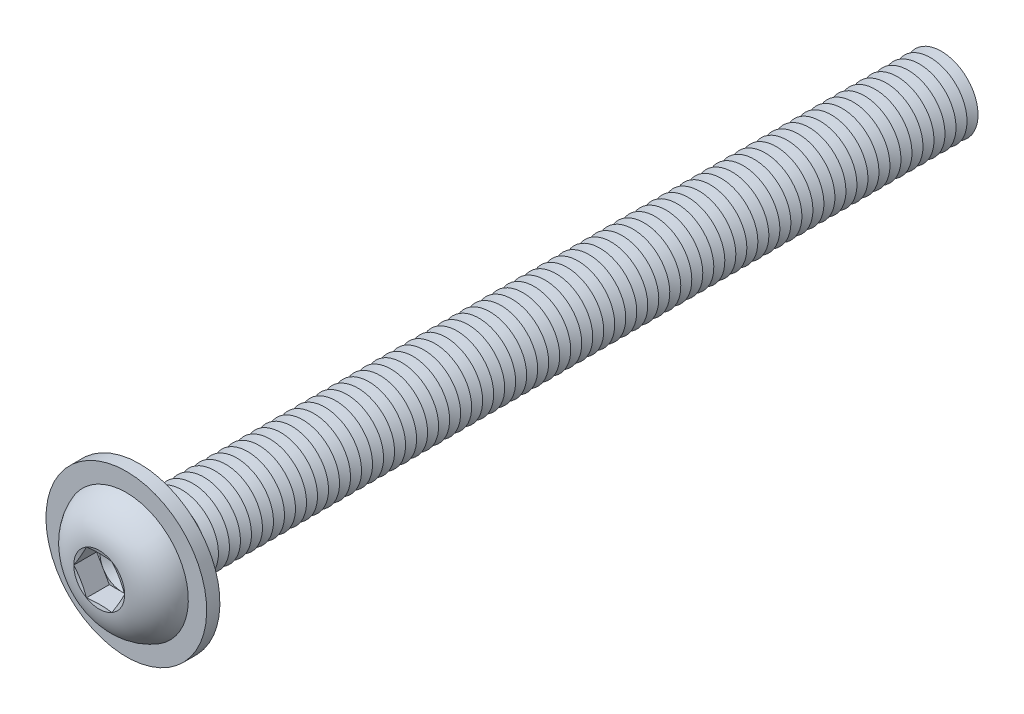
from build123d import *

# Parameters (mm, degrees)
FILLET1_R           = 0.75
LPATTERN1_COUNT     = 73
LPATTERN1_PITCH     = 1.5
CUT_EXTRUDE1_DEPTH  = 3.12
SKETCH5_R           = 10.95
SKETCH5_R_2         = 5.75
BOSS_EXTRUDE1_DEPTH = 1.8


with BuildPart() as part:
    # Sketch1 → Revolve1 (revolve)
    with BuildSketch(Plane(origin=(0, 0, 0), x_dir=(0, 0, -1), z_dir=(1, 0, 0))):
        with BuildLine():
            Line((0, 5), (0, 8.75))
            ThreePointArc((0, 8.75), (-3.814142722, 7.21429474), (-5.5, 3.4641))
            Line((-5.5, 3.4641), (-5.035898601, 1.73205))
            Line((-5.035898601, 1.73205), (-5.5, 1.73205))
            Line((-5.5, 1.73205), (-5.5, 0))
            Line((-5.5, 0), (110, 0))
            Line((110, 0), (110, 5))
            Line((110, 5), (0, 5))
        make_face()
    revolve(axis=Axis((0, 0, -110), (0, 0, 1)))

    # Fillet1
    fillet1_edges = [part.edges().sort_by_distance(p)[0] for p in [
        (0, -5, 0),
    ]]
    fillet(fillet1_edges, radius=FILLET1_R)

    # Sketch2 → Cut-Revolve1 (revolve, cut)
    with BuildSketch(Plane(origin=(0, 0, 0), x_dir=(0, 0, -1), z_dir=(1, 0, 0))):
        Polygon((109.25, 5), (110.75, 5), (110, 3.700961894), align=None)
    cut_revolve1 = revolve(axis=Axis((0, 0, -110), (0, 0, -1)), mode=Mode.SUBTRACT)

    # LPattern1: Cut-Revolve1 ×73
    with Locations(*[(0, 0, i * LPATTERN1_PITCH) for i in range(1, LPATTERN1_COUNT)]):
        add(cut_revolve1, mode=Mode.SUBTRACT)

    # Sketch3 → Cut-Extrude1 (cut)
    with BuildSketch(Plane.XY.offset(5.5)):
        Polygon((1.73205, 2.999998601), (-1.73205, 2.999998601), (-3.4641, 0), (-1.73205, -2.999998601), (1.73205, -2.999998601), (3.4641, 0), align=None)
    extrude(amount=-CUT_EXTRUDE1_DEPTH, mode=Mode.SUBTRACT)

    # Cut-Extrude2 cone 1 section (on through the dimple's axis) → Cut-Extrude2 (revolve, cut)
    with BuildSketch(Plane(origin=(0, 0, 2.38), x_dir=(0, -1, 0), z_dir=(1, 0, 0))):
        Polygon((0, 0), (2.999998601, 0), (0, 1.73205), align=None)
    revolve(axis=Axis((0, 0, 2.38), (0, 0, -1)), mode=Mode.SUBTRACT)

    # Sketch5 → Boss-Extrude1 (add)
    with BuildSketch(Plane(origin=(0, 0, 0), x_dir=(-1, 0, 0), z_dir=(0, 0, -1))):
        with Locations(Location((0, 0, 0), (0, 0, 90))):
            Circle(SKETCH5_R)
        Circle(SKETCH5_R_2, mode=Mode.SUBTRACT)
    extrude(amount=-BOSS_EXTRUDE1_DEPTH)


solid = part.part
